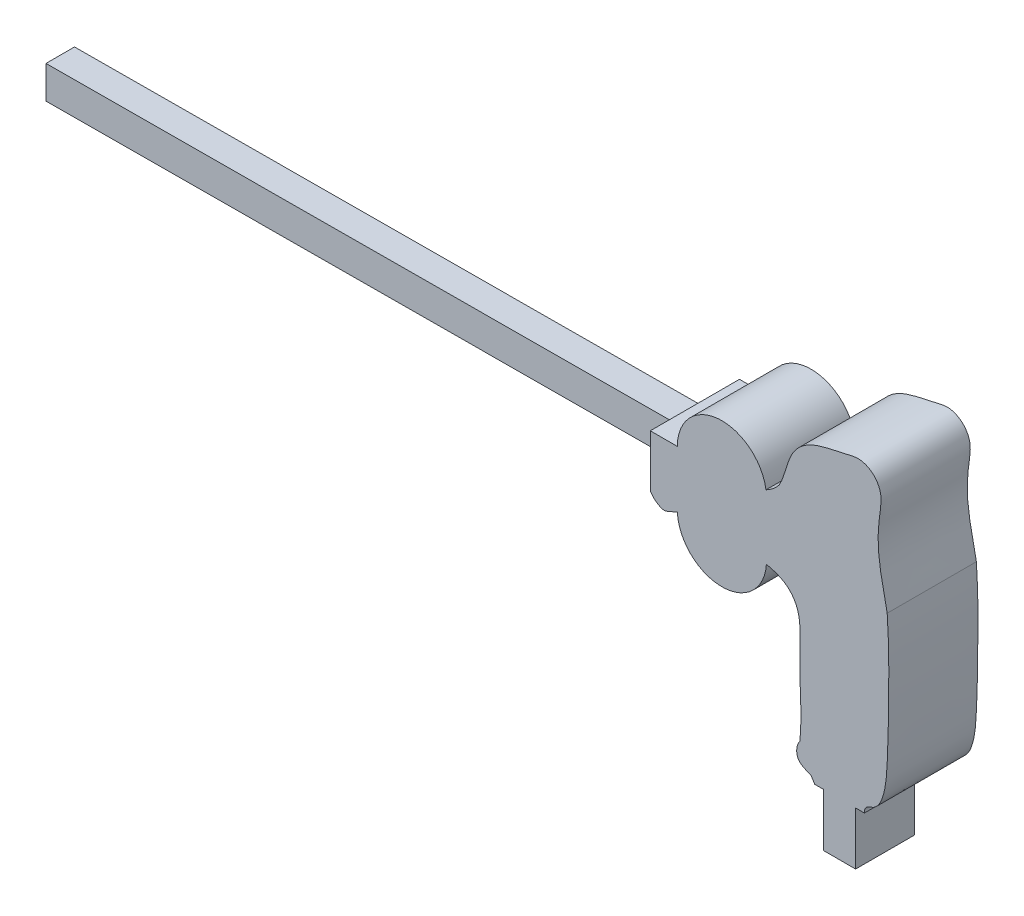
from build123d import *

# Parameters (mm, degrees)
BOSS_EXTRU_1_DEPTH      = 12.5
BOSS_EXTRU_1_DEPTH_BACK = 12.5
ENL_V_MAT_EXTRU_1_DEPTH = 8.5
ESQUISSE3_W             = 9.062851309
ESQUISSE3_H             = 14.846149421
ENL_V_MAT_EXTRU_2_DEPTH = 8.5
BOSS_EXTRU_2_DEPTH      = 25


with BuildPart() as part:
    # Esquisse1 → Boss.-Extru.1 (new, two sides: drawn at the far end of the back side and taken through both)
    with BuildSketch(Plane.XY.offset(-BOSS_EXTRU_1_DEPTH_BACK)):
        with BuildLine():
            Line((180.305389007, 79.110082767), (2.338587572, 78.24645057))
            Line((2.338587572, 78.24645057), (2.338587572, 69.090933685))
            Line((2.338587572, 69.090933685), (180.305389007, 69.954565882))
            Line((180.305389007, 69.954565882), (180.361785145, 67.488653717))
            add(Edge.make_bspline(
                [(189.551646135, 66.79791584), (188.085305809, 66.477610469), (186.437869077, 65.679537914), (184.118081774, 64.721888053), (182.103072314, 65.494117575), (180.94285159, 66.560326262), (180.361785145, 67.488653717)],
                knots=[0, 0, 0, 0, 0.423805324, 0.540106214, 0.695472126, 1, 1, 1, 1], degree=3))
            add(Edge.make_bspline(
                [(222.152115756, 27.827971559), (222.558851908, 31.631351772), (222.389816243, 38.657263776), (221.984082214, 48.087223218), (222.454796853, 55.059563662), (221.558317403, 60.198459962), (218.88801733, 64.047420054), (213.396994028, 66.370600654), (205.122737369, 67.107504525), (196.885705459, 66.795827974), (191.261165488, 66.950266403), (189.551646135, 66.79791584)],
                knots=[0, 0, 0, 0, 0.17224498, 0.316917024, 0.425895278, 0.486929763, 0.548937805, 0.628151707, 0.746241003, 0.922641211, 1, 1, 1, 1], degree=3))
            add(Edge.make_bspline(
                [(225.324340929, 21.081160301), (224.264133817, 21.615428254), (220.625725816, 22.580473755), (221.226759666, 26.678130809), (222.152115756, 27.827971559)],
                knots=[0, 0, 0, 0, 0.455083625, 1, 1, 1, 1], degree=3))
            Line((225.324340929, 21.081160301), (226.334854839, 19.477132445))
            Line((226.334854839, 19.477132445), (228.725327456, 19.477132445))
            Line((228.725327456, 19.477132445), (228.725327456, 4.630983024))
            Line((228.725327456, 4.630983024), (237.788178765, 4.630983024))
            Line((237.788178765, 4.630983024), (237.788178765, 19.477132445))
            Line((237.788178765, 19.477132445), (240.256659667, 19.477132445))
            add(Edge.make_bspline(
                [(246.644185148, 71.17707534), (247.180317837, 64.044829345), (247.094622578, 51.860600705), (246.842250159, 36.914534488), (246.239670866, 27.941479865), (244.541512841, 23.663381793), (242.917121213, 21.981374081), (240.926921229, 21.566845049), (240.0980413, 20.324515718), (240.256659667, 19.477132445)],
                knots=[0, 0, 0, 0, 0.397196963, 0.674787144, 0.833472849, 0.890972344, 0.92753508, 0.957353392, 1, 1, 1, 1], degree=3))
            add(Edge.make_bspline(
                [(216.398749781, 87.183666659), (218.165596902, 90.424552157), (218.629506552, 96.091192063), (224.401035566, 101.435637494), (229.913614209, 102.993637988), (234.862449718, 103.91827726), (238.404865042, 104.875412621), (241.283224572, 104.176054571), (243.704467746, 102.223072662), (245.086282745, 99.27251882), (244.81893962, 95.536181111), (244.083507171, 91.015197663), (243.982471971, 82.591410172), (245.727527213, 75.890428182), (246.644185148, 71.17707534)],
                knots=[0, 0, 0, 0, 0.165543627, 0.2267094, 0.335348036, 0.411382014, 0.450687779, 0.494901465, 0.535748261, 0.5846208, 0.631436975, 0.698099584, 0.787371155, 1, 1, 1, 1], degree=3))
            add(Edge.make_bspline(
                [(204.097355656, 82.256969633), (208.578807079, 82.323612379), (213.460430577, 83.448945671), (216.398749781, 87.183666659)],
                knots=[0, 0, 0, 0, 1, 1, 1, 1], degree=3))
            Line((204.097355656, 82.256969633), (180.233418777, 82.256969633))
            Line((180.233418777, 82.256969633), (180.305389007, 79.110082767))
        make_face()
    extrude(amount=BOSS_EXTRU_1_DEPTH + BOSS_EXTRU_1_DEPTH_BACK)

    # Esquisse2 → Enl_v. mat.-Extru.1 (cut)
    with BuildSketch(Plane.XY.offset(12.5)):
        Polygon((2.338587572, 69.090933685), (180.305389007, 69.954565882), (180.305389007, 79.110082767), (2.338587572, 78.24645057), align=None)
    enl_v_mat_extru_1 = extrude(amount=-ENL_V_MAT_EXTRU_1_DEPTH, mode=Mode.SUBTRACT)

    # Sym_trie1: Enl_v. mat.-Extru.1 across plane
    add(enl_v_mat_extru_1.mirror(Plane.XY), mode=Mode.SUBTRACT)

    # Esquisse3 → Enl_v. mat.-Extru.2 (cut)
    with BuildSketch(Plane(origin=(0, 0, -12.5), x_dir=(-1, 0, 0), z_dir=(0, 0, -1))):
        with Locations((-233.256753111, 12.054057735)):
            Rectangle(ESQUISSE3_W, ESQUISSE3_H)
    extrude(amount=-ENL_V_MAT_EXTRU_2_DEPTH, mode=Mode.SUBTRACT)

    # Esquisse4 → Boss.-Extru.2 (add)
    with BuildSketch(Plane.XY.offset(12.5)):
        with BuildLine():
            Line((204.097355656, 82.256969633), (187.805389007, 82.256969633))
            ThreePointArc((187.805389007, 82.256969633), (199.363348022, 94.721421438), (212.663398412, 84.135693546))
            add(Edge.make_bspline(
                [(212.663398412, 84.135693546), (210.063638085, 82.786346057), (206.996745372, 82.300085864), (204.097355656, 82.256969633)],
                knots=[0.353024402, 0.353024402, 0.353024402, 0.353024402, 1, 1, 1, 1], degree=3))
        make_face()
        with BuildLine():
            ThreePointArc((187.821930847, 66.27486626), (200.244027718, 54.417879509), (212.781934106, 66.152338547))
            add(Edge.make_bspline(
                [(189.551646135, 66.79791584), (191.261165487, 66.950266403), (196.885705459, 66.795827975), (204.642967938, 67.089350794), (210.68399316, 66.607742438), (212.781934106, 66.152338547)],
                knots=[0, 0, 0, 0, 0.077358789, 0.253758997, 0.350189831, 0.350189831, 0.350189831, 0.350189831], degree=3))
            add(Edge.make_bspline(
                [(187.821930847, 66.27486626), (188.381712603, 66.48488659), (188.952167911, 66.666966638), (189.551646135, 66.79791584)],
                knots=[0.826737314, 0.826737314, 0.826737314, 0.826737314, 1, 1, 1, 1], degree=3))
        make_face()
    extrude(amount=-BOSS_EXTRU_2_DEPTH)


solid = part.part
